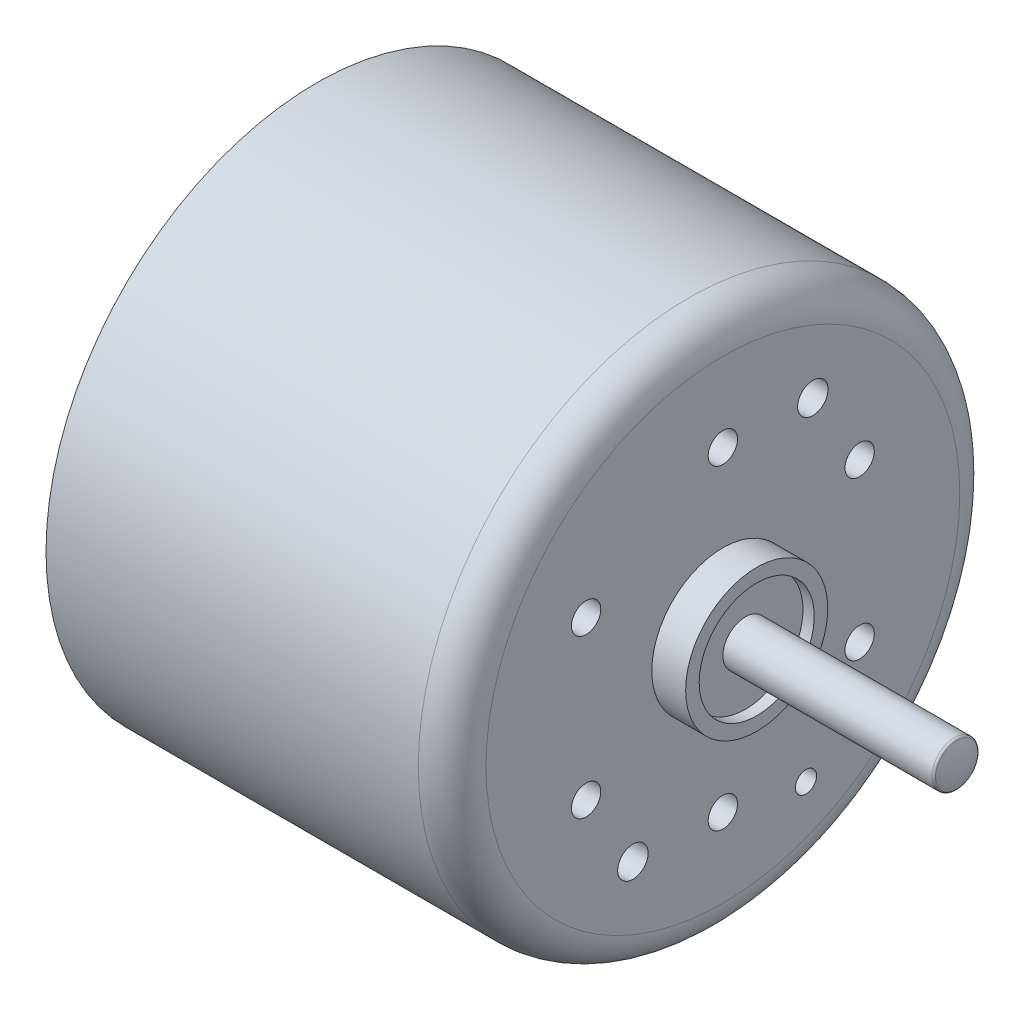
from build123d import *

# Parameters (mm, degrees)
ESQUISSE2_R             = 0.65
ESQUISSE2_R_2           = 0.675
ESQUISSE2_R_3           = 0.471742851
ENL_V_MAT_EXTRU_1_DEPTH = 3


with BuildPart() as part:
    # Esquisse1 → R_volution7 (revolve)
    with BuildSketch(Plane.XY, mode=Mode.PRIVATE) as r_volution7_sk:
        with BuildLine():
            Line((0, 0.873400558), (0, 0))
            Line((0, 0), (30.5, 0))
            ThreePointArc((30.5, 0), (30.479020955, 0.474206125), (30.36237382, 0.934320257))
            ThreePointArc((30.36237382, 0.934320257), (30.325753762, 0.981951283), (30.268447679, 1))
            Line((30.268447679, 1), (21, 1))
            Line((21, 1), (21, 2.55))
            Line((21, 2.55), (21.5, 2.55))
            Line((21.5, 2.55), (21.5, 3.15))
            Line((21.5, 3.15), (20, 3.15))
            Line((20, 3.15), (20, 10.5))
            ThreePointArc((20, 10.5), (19.560660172, 11.560660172), (18.5, 12))
            Line((18.5, 12), (2, 12))
            Line((2, 12), (2, 11.4))
            Line((2, 11.4), (2.5, 11.4))
            Line((2.5, 11.4), (2.5, 3.2))
            Line((2.5, 3.2), (1.035884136, 3.2))
            ThreePointArc((1.035884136, 3.2), (0.776449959, 3.127427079), (0.592327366, 2.930775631))
            ThreePointArc((0.592327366, 2.930775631), (0.193252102, 1.931716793), (0, 0.873400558))
        make_face()
    revolve(r_volution7_sk.sketch.rotate(Axis((0, 0, 0), (1, 0, 0)), 90), axis=Axis((0, 0, 0), (1, 0, 0)))

    # Esquisse2 → Enl_v. mat.-Extru.1 (cut)
    with BuildSketch(Plane(origin=(20, 0, 0), x_dir=(0, 0, -1), z_dir=(1, 0, 0))):
        with Locations((0, 7)):
            Circle(ESQUISSE2_R)
        with Locations((6.062177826, 3.5)):
            Circle(ESQUISSE2_R)
        with Locations((6.062177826, -3.5)):
            Circle(ESQUISSE2_R)
        with Locations((0, -7)):
            Circle(ESQUISSE2_R)
        with Locations((-6.062177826, -3.5)):
            Circle(ESQUISSE2_R)
        with Locations((-6.062177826, 3.5)):
            Circle(ESQUISSE2_R)
        with Locations((3.9875, 6.906552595)):
            Circle(ESQUISSE2_R_2)
        with Locations(Location((-3.9875, -6.906552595, 0), (0, 0, 180))):
            Circle(ESQUISSE2_R_2)
        with Locations((3.683223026, -7.674893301)):
            Circle(ESQUISSE2_R_3)
    extrude(amount=-ENL_V_MAT_EXTRU_1_DEPTH, mode=Mode.SUBTRACT)


solid = part.part
